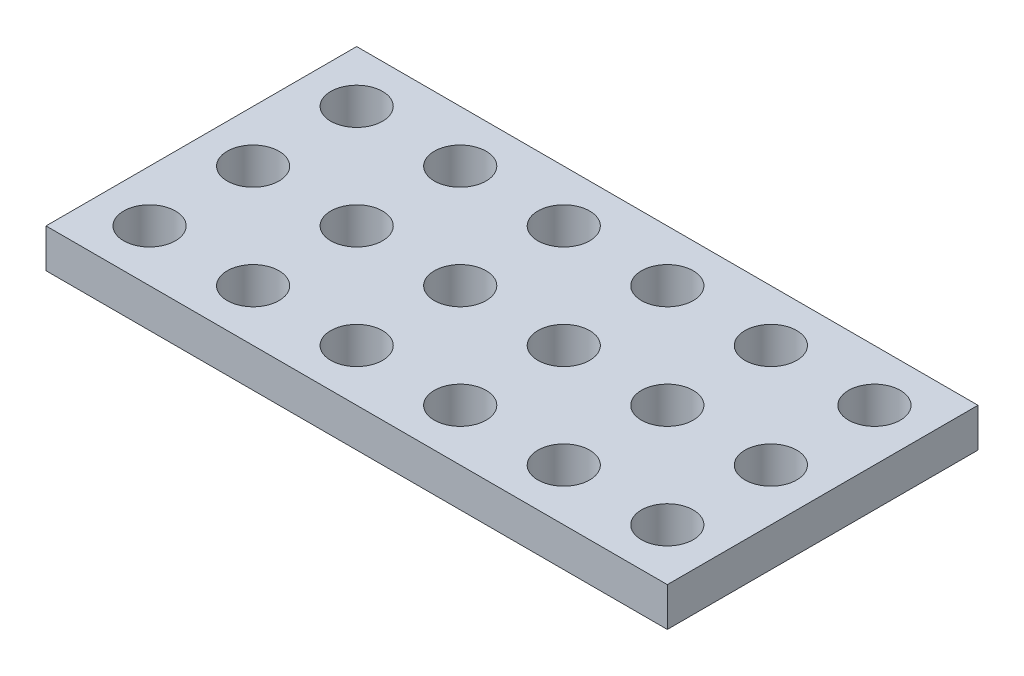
ISO-10303-21;
HEADER;
FILE_DESCRIPTION(('STEP AP214'),'2;1');
FILE_NAME('part.step','',(''),(''),'','','');
FILE_SCHEMA(('AUTOMOTIVE_DESIGN { 1 0 10303 214 1 1 1 1 }'));
ENDSEC;
DATA;
#1=APPLICATION_CONTEXT('core data for automotive mechanical design processes');
#2=APPLICATION_PROTOCOL_DEFINITION('international standard','automotive_design',2000,#1);
#3=PRODUCT_CONTEXT('',#1,'mechanical');
#4=PRODUCT('Part','Part','',(#3));
#5=PRODUCT_RELATED_PRODUCT_CATEGORY('part','',(#4));
#6=PRODUCT_DEFINITION_FORMATION('','',#4);
#7=PRODUCT_DEFINITION_CONTEXT('part definition',#1,'design');
#8=PRODUCT_DEFINITION('design','',#6,#7);
#9=PRODUCT_DEFINITION_SHAPE('','',#8);
#10=(LENGTH_UNIT() NAMED_UNIT(*) SI_UNIT(.MILLI.,.METRE.));
#11=(NAMED_UNIT(*) PLANE_ANGLE_UNIT() SI_UNIT($,.RADIAN.));
#12=(NAMED_UNIT(*) SI_UNIT($,.STERADIAN.) SOLID_ANGLE_UNIT());
#13=UNCERTAINTY_MEASURE_WITH_UNIT(LENGTH_MEASURE(1.E-05),#10,'distance_accuracy_value','');
#14=(GEOMETRIC_REPRESENTATION_CONTEXT(3) GLOBAL_UNCERTAINTY_ASSIGNED_CONTEXT((#13)) GLOBAL_UNIT_ASSIGNED_CONTEXT((#10,
#11,#12)) REPRESENTATION_CONTEXT('',''));
#15=CARTESIAN_POINT('',(0.,0.,0.));
#16=DIRECTION('',(0.,0.,1.));
#17=DIRECTION('',(1.,0.,0.));
#18=AXIS2_PLACEMENT_3D('',#15,#16,#17);
#19=CARTESIAN_POINT('',(0.,3.,0.));
#20=DIRECTION('',(0.,1.,0.));
#21=DIRECTION('',(0.,0.,1.));
#22=AXIS2_PLACEMENT_3D('',#19,#20,#21);
#23=PLANE('',#22);
#24=CARTESIAN_POINT('',(14.2666666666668,3.,9.06666666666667));
#25=DIRECTION('',(0.,1.,0.));
#26=DIRECTION('',(0.,0.,1.));
#27=AXIS2_PLACEMENT_3D('',#24,#25,#26);
#28=CIRCLE('',#27,2.);
#29=CARTESIAN_POINT('',(14.2666666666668,3.,11.0666666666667));
#30=VERTEX_POINT('',#29);
#31=EDGE_CURVE('E207',#30,#30,#28,.T.);
#32=ORIENTED_EDGE('',*,*,#31,.F.);
#33=EDGE_LOOP('',(#32));
#34=FACE_BOUND('',#33,.T.);
#35=CARTESIAN_POINT('',(-1.73333333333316,3.,9.06666666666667));
#36=DIRECTION('',(0.,1.,0.));
#37=DIRECTION('',(0.,0.,1.));
#38=AXIS2_PLACEMENT_3D('',#35,#36,#37);
#39=CIRCLE('',#38,2.);
#40=CARTESIAN_POINT('',(-1.73333333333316,3.,11.0666666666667));
#41=VERTEX_POINT('',#40);
#42=EDGE_CURVE('E195',#41,#41,#39,.T.);
#43=ORIENTED_EDGE('',*,*,#42,.F.);
#44=EDGE_LOOP('',(#43));
#45=FACE_BOUND('',#44,.T.);
#46=CARTESIAN_POINT('',(-17.7333333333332,3.,9.06666666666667));
#47=DIRECTION('',(0.,1.,0.));
#48=DIRECTION('',(0.,0.,1.));
#49=AXIS2_PLACEMENT_3D('',#46,#47,#48);
#50=CIRCLE('',#49,2.);
#51=CARTESIAN_POINT('',(-17.7333333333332,3.,11.0666666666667));
#52=VERTEX_POINT('',#51);
#53=EDGE_CURVE('E183',#52,#52,#50,.T.);
#54=ORIENTED_EDGE('',*,*,#53,.F.);
#55=EDGE_LOOP('',(#54));
#56=FACE_BOUND('',#55,.T.);
#57=CARTESIAN_POINT('',(14.2666666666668,3.,1.06666666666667));
#58=DIRECTION('',(0.,1.,0.));
#59=DIRECTION('',(0.,0.,1.));
#60=AXIS2_PLACEMENT_3D('',#57,#58,#59);
#61=CIRCLE('',#60,2.);
#62=CARTESIAN_POINT('',(14.2666666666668,3.,3.06666666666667));
#63=VERTEX_POINT('',#62);
#64=EDGE_CURVE('E171',#63,#63,#61,.T.);
#65=ORIENTED_EDGE('',*,*,#64,.F.);
#66=EDGE_LOOP('',(#65));
#67=FACE_BOUND('',#66,.T.);
#68=CARTESIAN_POINT('',(-1.73333333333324,3.,1.06666666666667));
#69=DIRECTION('',(0.,1.,0.));
#70=DIRECTION('',(0.,0.,1.));
#71=AXIS2_PLACEMENT_3D('',#68,#69,#70);
#72=CIRCLE('',#71,2.);
#73=CARTESIAN_POINT('',(-1.73333333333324,3.,3.06666666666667));
#74=VERTEX_POINT('',#73);
#75=EDGE_CURVE('E159',#74,#74,#72,.T.);
#76=ORIENTED_EDGE('',*,*,#75,.F.);
#77=EDGE_LOOP('',(#76));
#78=FACE_BOUND('',#77,.T.);
#79=CARTESIAN_POINT('',(-17.7333333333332,3.,1.06666666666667));
#80=DIRECTION('',(0.,1.,0.));
#81=DIRECTION('',(0.,0.,1.));
#82=AXIS2_PLACEMENT_3D('',#79,#80,#81);
#83=CIRCLE('',#82,2.);
#84=CARTESIAN_POINT('',(-17.7333333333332,3.,3.06666666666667));
#85=VERTEX_POINT('',#84);
#86=EDGE_CURVE('E147',#85,#85,#83,.T.);
#87=ORIENTED_EDGE('',*,*,#86,.F.);
#88=EDGE_LOOP('',(#87));
#89=FACE_BOUND('',#88,.T.);
#90=CARTESIAN_POINT('',(14.2666666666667,3.,-6.93333333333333));
#91=DIRECTION('',(0.,1.,0.));
#92=DIRECTION('',(0.,0.,1.));
#93=AXIS2_PLACEMENT_3D('',#90,#91,#92);
#94=CIRCLE('',#93,2.);
#95=CARTESIAN_POINT('',(14.2666666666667,3.,-4.93333333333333));
#96=VERTEX_POINT('',#95);
#97=EDGE_CURVE('E135',#96,#96,#94,.T.);
#98=ORIENTED_EDGE('',*,*,#97,.F.);
#99=EDGE_LOOP('',(#98));
#100=FACE_BOUND('',#99,.T.);
#101=CARTESIAN_POINT('',(-1.73333333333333,3.,-6.93333333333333));
#102=DIRECTION('',(0.,1.,0.));
#103=DIRECTION('',(0.,0.,1.));
#104=AXIS2_PLACEMENT_3D('',#101,#102,#103);
#105=CIRCLE('',#104,2.);
#106=CARTESIAN_POINT('',(-1.73333333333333,3.,-4.93333333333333));
#107=VERTEX_POINT('',#106);
#108=EDGE_CURVE('E123',#107,#107,#105,.T.);
#109=ORIENTED_EDGE('',*,*,#108,.F.);
#110=EDGE_LOOP('',(#109));
#111=FACE_BOUND('',#110,.T.);
#112=CARTESIAN_POINT('',(-17.7333333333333,3.,-6.93333333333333));
#113=DIRECTION('',(0.,1.,0.));
#114=DIRECTION('',(0.,0.,1.));
#115=AXIS2_PLACEMENT_3D('',#112,#113,#114);
#116=CIRCLE('',#115,2.);
#117=CARTESIAN_POINT('',(-17.7333333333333,3.,-4.93333333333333));
#118=VERTEX_POINT('',#117);
#119=EDGE_CURVE('E102',#118,#118,#116,.T.);
#120=ORIENTED_EDGE('',*,*,#119,.F.);
#121=EDGE_LOOP('',(#120));
#122=FACE_BOUND('',#121,.T.);
#123=DIRECTION('',(0.,0.,1.));
#124=VECTOR('',#123,1.);
#125=CARTESIAN_POINT('',(-21.7333333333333,3.,-10.9333333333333));
#126=LINE('',#125,#124);
#127=CARTESIAN_POINT('',(-21.7333333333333,3.,-10.9333333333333));
#128=VERTEX_POINT('',#127);
#129=CARTESIAN_POINT('',(-21.7333333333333,3.,13.0666666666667));
#130=VERTEX_POINT('',#129);
#131=EDGE_CURVE('E87',#128,#130,#126,.T.);
#132=ORIENTED_EDGE('',*,*,#131,.T.);
#133=DIRECTION('',(1.,0.,0.));
#134=VECTOR('',#133,1.);
#135=CARTESIAN_POINT('',(-21.7333333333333,3.,13.0666666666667));
#136=LINE('',#135,#134);
#137=CARTESIAN_POINT('',(26.2666666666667,3.,13.0666666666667));
#138=VERTEX_POINT('',#137);
#139=EDGE_CURVE('E82',#130,#138,#136,.T.);
#140=ORIENTED_EDGE('',*,*,#139,.T.);
#141=DIRECTION('',(0.,0.,-1.));
#142=VECTOR('',#141,1.);
#143=CARTESIAN_POINT('',(26.2666666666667,3.,-10.9333333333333));
#144=LINE('',#143,#142);
#145=CARTESIAN_POINT('',(26.2666666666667,3.,-10.9333333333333));
#146=VERTEX_POINT('',#145);
#147=EDGE_CURVE('E85',#138,#146,#144,.T.);
#148=ORIENTED_EDGE('',*,*,#147,.T.);
#149=DIRECTION('',(-1.,0.,0.));
#150=VECTOR('',#149,1.);
#151=CARTESIAN_POINT('',(-21.7333333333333,3.,-10.9333333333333));
#152=LINE('',#151,#150);
#153=EDGE_CURVE('E52',#146,#128,#152,.T.);
#154=ORIENTED_EDGE('',*,*,#153,.T.);
#155=EDGE_LOOP('',(#132,#140,#148,#154));
#156=FACE_BOUND('',#155,.T.);
#157=CARTESIAN_POINT('',(-9.73333333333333,3.,-6.93333333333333));
#158=DIRECTION('',(0.,1.,0.));
#159=DIRECTION('',(0.,0.,1.));
#160=AXIS2_PLACEMENT_3D('',#157,#158,#159);
#161=CIRCLE('',#160,2.);
#162=CARTESIAN_POINT('',(-9.73333333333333,3.,-4.93333333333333));
#163=VERTEX_POINT('',#162);
#164=EDGE_CURVE('E117',#163,#163,#161,.T.);
#165=ORIENTED_EDGE('',*,*,#164,.F.);
#166=EDGE_LOOP('',(#165));
#167=FACE_BOUND('',#166,.T.);
#168=CARTESIAN_POINT('',(6.26666666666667,3.,-6.93333333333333));
#169=DIRECTION('',(0.,1.,0.));
#170=DIRECTION('',(0.,0.,1.));
#171=AXIS2_PLACEMENT_3D('',#168,#169,#170);
#172=CIRCLE('',#171,2.);
#173=CARTESIAN_POINT('',(6.26666666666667,3.,-4.93333333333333));
#174=VERTEX_POINT('',#173);
#175=EDGE_CURVE('E129',#174,#174,#172,.T.);
#176=ORIENTED_EDGE('',*,*,#175,.F.);
#177=EDGE_LOOP('',(#176));
#178=FACE_BOUND('',#177,.T.);
#179=CARTESIAN_POINT('',(22.2666666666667,3.,-6.93333333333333));
#180=DIRECTION('',(0.,1.,0.));
#181=DIRECTION('',(0.,0.,1.));
#182=AXIS2_PLACEMENT_3D('',#179,#180,#181);
#183=CIRCLE('',#182,2.);
#184=CARTESIAN_POINT('',(22.2666666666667,3.,-4.93333333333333));
#185=VERTEX_POINT('',#184);
#186=EDGE_CURVE('E141',#185,#185,#183,.T.);
#187=ORIENTED_EDGE('',*,*,#186,.F.);
#188=EDGE_LOOP('',(#187));
#189=FACE_BOUND('',#188,.T.);
#190=CARTESIAN_POINT('',(-9.73333333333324,3.,1.06666666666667));
#191=DIRECTION('',(0.,1.,0.));
#192=DIRECTION('',(0.,0.,1.));
#193=AXIS2_PLACEMENT_3D('',#190,#191,#192);
#194=CIRCLE('',#193,2.);
#195=CARTESIAN_POINT('',(-9.73333333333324,3.,3.06666666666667));
#196=VERTEX_POINT('',#195);
#197=EDGE_CURVE('E153',#196,#196,#194,.T.);
#198=ORIENTED_EDGE('',*,*,#197,.F.);
#199=EDGE_LOOP('',(#198));
#200=FACE_BOUND('',#199,.T.);
#201=CARTESIAN_POINT('',(6.26666666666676,3.,1.06666666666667));
#202=DIRECTION('',(0.,1.,0.));
#203=DIRECTION('',(0.,0.,1.));
#204=AXIS2_PLACEMENT_3D('',#201,#202,#203);
#205=CIRCLE('',#204,2.);
#206=CARTESIAN_POINT('',(6.26666666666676,3.,3.06666666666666));
#207=VERTEX_POINT('',#206);
#208=EDGE_CURVE('E165',#207,#207,#205,.T.);
#209=ORIENTED_EDGE('',*,*,#208,.F.);
#210=EDGE_LOOP('',(#209));
#211=FACE_BOUND('',#210,.T.);
#212=CARTESIAN_POINT('',(22.2666666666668,3.,1.06666666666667));
#213=DIRECTION('',(0.,1.,0.));
#214=DIRECTION('',(0.,0.,1.));
#215=AXIS2_PLACEMENT_3D('',#212,#213,#214);
#216=CIRCLE('',#215,2.);
#217=CARTESIAN_POINT('',(22.2666666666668,3.,3.06666666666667));
#218=VERTEX_POINT('',#217);
#219=EDGE_CURVE('E177',#218,#218,#216,.T.);
#220=ORIENTED_EDGE('',*,*,#219,.F.);
#221=EDGE_LOOP('',(#220));
#222=FACE_BOUND('',#221,.T.);
#223=CARTESIAN_POINT('',(-9.73333333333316,3.,9.06666666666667));
#224=DIRECTION('',(0.,1.,0.));
#225=DIRECTION('',(0.,0.,1.));
#226=AXIS2_PLACEMENT_3D('',#223,#224,#225);
#227=CIRCLE('',#226,2.);
#228=CARTESIAN_POINT('',(-9.73333333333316,3.,11.0666666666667));
#229=VERTEX_POINT('',#228);
#230=EDGE_CURVE('E189',#229,#229,#227,.T.);
#231=ORIENTED_EDGE('',*,*,#230,.F.);
#232=EDGE_LOOP('',(#231));
#233=FACE_BOUND('',#232,.T.);
#234=CARTESIAN_POINT('',(6.26666666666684,3.,9.06666666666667));
#235=DIRECTION('',(0.,1.,0.));
#236=DIRECTION('',(0.,0.,1.));
#237=AXIS2_PLACEMENT_3D('',#234,#235,#236);
#238=CIRCLE('',#237,2.);
#239=CARTESIAN_POINT('',(6.26666666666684,3.,11.0666666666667));
#240=VERTEX_POINT('',#239);
#241=EDGE_CURVE('E201',#240,#240,#238,.T.);
#242=ORIENTED_EDGE('',*,*,#241,.F.);
#243=EDGE_LOOP('',(#242));
#244=FACE_BOUND('',#243,.T.);
#245=CARTESIAN_POINT('',(22.2666666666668,3.,9.06666666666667));
#246=DIRECTION('',(0.,1.,0.));
#247=DIRECTION('',(0.,0.,1.));
#248=AXIS2_PLACEMENT_3D('',#245,#246,#247);
#249=CIRCLE('',#248,2.);
#250=CARTESIAN_POINT('',(22.2666666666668,3.,11.0666666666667));
#251=VERTEX_POINT('',#250);
#252=EDGE_CURVE('E213',#251,#251,#249,.T.);
#253=ORIENTED_EDGE('',*,*,#252,.F.);
#254=EDGE_LOOP('',(#253));
#255=FACE_BOUND('',#254,.T.);
#256=ADVANCED_FACE('F35',(#34,#45,#56,#67,#78,#89,#100,#111,#122,#156,#167,#178,#189,#200,#211,
#222,#233,#244,#255),#23,.T.);
#257=CARTESIAN_POINT('',(0.,0.,0.));
#258=DIRECTION('',(0.,1.,0.));
#259=DIRECTION('',(0.,0.,1.));
#260=AXIS2_PLACEMENT_3D('',#257,#258,#259);
#261=PLANE('',#260);
#262=DIRECTION('',(0.,0.,1.));
#263=VECTOR('',#262,1.);
#264=CARTESIAN_POINT('',(-21.7333333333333,0.,-10.9333333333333));
#265=LINE('',#264,#263);
#266=CARTESIAN_POINT('',(-21.7333333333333,0.,-10.9333333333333));
#267=VERTEX_POINT('',#266);
#268=CARTESIAN_POINT('',(-21.7333333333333,0.,13.0666666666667));
#269=VERTEX_POINT('',#268);
#270=EDGE_CURVE('E99',#267,#269,#265,.T.);
#271=ORIENTED_EDGE('',*,*,#270,.F.);
#272=DIRECTION('',(-1.,0.,0.));
#273=VECTOR('',#272,1.);
#274=CARTESIAN_POINT('',(-21.7333333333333,0.,-10.9333333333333));
#275=LINE('',#274,#273);
#276=CARTESIAN_POINT('',(26.2666666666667,0.,-10.9333333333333));
#277=VERTEX_POINT('',#276);
#278=EDGE_CURVE('E75',#277,#267,#275,.T.);
#279=ORIENTED_EDGE('',*,*,#278,.F.);
#280=DIRECTION('',(0.,0.,-1.));
#281=VECTOR('',#280,1.);
#282=CARTESIAN_POINT('',(26.2666666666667,0.,-10.9333333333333));
#283=LINE('',#282,#281);
#284=CARTESIAN_POINT('',(26.2666666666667,0.,13.0666666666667));
#285=VERTEX_POINT('',#284);
#286=EDGE_CURVE('E69',#285,#277,#283,.T.);
#287=ORIENTED_EDGE('',*,*,#286,.F.);
#288=DIRECTION('',(1.,0.,0.));
#289=VECTOR('',#288,1.);
#290=CARTESIAN_POINT('',(-21.7333333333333,0.,13.0666666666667));
#291=LINE('',#290,#289);
#292=EDGE_CURVE('E91',#269,#285,#291,.T.);
#293=ORIENTED_EDGE('',*,*,#292,.F.);
#294=EDGE_LOOP('',(#271,#279,#287,#293));
#295=FACE_BOUND('',#294,.T.);
#296=CARTESIAN_POINT('',(-17.7333333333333,0.,-6.93333333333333));
#297=DIRECTION('',(0.,1.,0.));
#298=DIRECTION('',(0.,0.,1.));
#299=AXIS2_PLACEMENT_3D('',#296,#297,#298);
#300=CIRCLE('',#299,2.);
#301=CARTESIAN_POINT('',(-17.7333333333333,0.,-4.93333333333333));
#302=VERTEX_POINT('',#301);
#303=EDGE_CURVE('E114',#302,#302,#300,.T.);
#304=ORIENTED_EDGE('',*,*,#303,.T.);
#305=EDGE_LOOP('',(#304));
#306=FACE_BOUND('',#305,.T.);
#307=CARTESIAN_POINT('',(-9.73333333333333,0.,-6.93333333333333));
#308=DIRECTION('',(0.,1.,0.));
#309=DIRECTION('',(0.,0.,1.));
#310=AXIS2_PLACEMENT_3D('',#307,#308,#309);
#311=CIRCLE('',#310,2.);
#312=CARTESIAN_POINT('',(-9.73333333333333,0.,-4.93333333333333));
#313=VERTEX_POINT('',#312);
#314=EDGE_CURVE('E120',#313,#313,#311,.T.);
#315=ORIENTED_EDGE('',*,*,#314,.T.);
#316=EDGE_LOOP('',(#315));
#317=FACE_BOUND('',#316,.T.);
#318=CARTESIAN_POINT('',(-1.73333333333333,0.,-6.93333333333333));
#319=DIRECTION('',(0.,1.,0.));
#320=DIRECTION('',(0.,0.,1.));
#321=AXIS2_PLACEMENT_3D('',#318,#319,#320);
#322=CIRCLE('',#321,2.);
#323=CARTESIAN_POINT('',(-1.73333333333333,0.,-4.93333333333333));
#324=VERTEX_POINT('',#323);
#325=EDGE_CURVE('E126',#324,#324,#322,.T.);
#326=ORIENTED_EDGE('',*,*,#325,.T.);
#327=EDGE_LOOP('',(#326));
#328=FACE_BOUND('',#327,.T.);
#329=CARTESIAN_POINT('',(6.26666666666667,0.,-6.93333333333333));
#330=DIRECTION('',(0.,1.,0.));
#331=DIRECTION('',(0.,0.,1.));
#332=AXIS2_PLACEMENT_3D('',#329,#330,#331);
#333=CIRCLE('',#332,2.);
#334=CARTESIAN_POINT('',(6.26666666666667,0.,-4.93333333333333));
#335=VERTEX_POINT('',#334);
#336=EDGE_CURVE('E132',#335,#335,#333,.T.);
#337=ORIENTED_EDGE('',*,*,#336,.T.);
#338=EDGE_LOOP('',(#337));
#339=FACE_BOUND('',#338,.T.);
#340=CARTESIAN_POINT('',(14.2666666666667,0.,-6.93333333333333));
#341=DIRECTION('',(0.,1.,0.));
#342=DIRECTION('',(0.,0.,1.));
#343=AXIS2_PLACEMENT_3D('',#340,#341,#342);
#344=CIRCLE('',#343,2.);
#345=CARTESIAN_POINT('',(14.2666666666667,0.,-4.93333333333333));
#346=VERTEX_POINT('',#345);
#347=EDGE_CURVE('E138',#346,#346,#344,.T.);
#348=ORIENTED_EDGE('',*,*,#347,.T.);
#349=EDGE_LOOP('',(#348));
#350=FACE_BOUND('',#349,.T.);
#351=CARTESIAN_POINT('',(22.2666666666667,0.,-6.93333333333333));
#352=DIRECTION('',(0.,1.,0.));
#353=DIRECTION('',(0.,0.,1.));
#354=AXIS2_PLACEMENT_3D('',#351,#352,#353);
#355=CIRCLE('',#354,2.);
#356=CARTESIAN_POINT('',(22.2666666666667,0.,-4.93333333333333));
#357=VERTEX_POINT('',#356);
#358=EDGE_CURVE('E144',#357,#357,#355,.T.);
#359=ORIENTED_EDGE('',*,*,#358,.T.);
#360=EDGE_LOOP('',(#359));
#361=FACE_BOUND('',#360,.T.);
#362=CARTESIAN_POINT('',(-17.7333333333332,0.,1.06666666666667));
#363=DIRECTION('',(0.,1.,0.));
#364=DIRECTION('',(0.,0.,1.));
#365=AXIS2_PLACEMENT_3D('',#362,#363,#364);
#366=CIRCLE('',#365,2.);
#367=CARTESIAN_POINT('',(-17.7333333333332,0.,3.06666666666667));
#368=VERTEX_POINT('',#367);
#369=EDGE_CURVE('E150',#368,#368,#366,.T.);
#370=ORIENTED_EDGE('',*,*,#369,.T.);
#371=EDGE_LOOP('',(#370));
#372=FACE_BOUND('',#371,.T.);
#373=CARTESIAN_POINT('',(-9.73333333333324,0.,1.06666666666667));
#374=DIRECTION('',(0.,1.,0.));
#375=DIRECTION('',(0.,0.,1.));
#376=AXIS2_PLACEMENT_3D('',#373,#374,#375);
#377=CIRCLE('',#376,2.);
#378=CARTESIAN_POINT('',(-9.73333333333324,0.,3.06666666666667));
#379=VERTEX_POINT('',#378);
#380=EDGE_CURVE('E156',#379,#379,#377,.T.);
#381=ORIENTED_EDGE('',*,*,#380,.T.);
#382=EDGE_LOOP('',(#381));
#383=FACE_BOUND('',#382,.T.);
#384=CARTESIAN_POINT('',(-1.73333333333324,0.,1.06666666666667));
#385=DIRECTION('',(0.,1.,0.));
#386=DIRECTION('',(0.,0.,1.));
#387=AXIS2_PLACEMENT_3D('',#384,#385,#386);
#388=CIRCLE('',#387,2.);
#389=CARTESIAN_POINT('',(-1.73333333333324,0.,3.06666666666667));
#390=VERTEX_POINT('',#389);
#391=EDGE_CURVE('E162',#390,#390,#388,.T.);
#392=ORIENTED_EDGE('',*,*,#391,.T.);
#393=EDGE_LOOP('',(#392));
#394=FACE_BOUND('',#393,.T.);
#395=CARTESIAN_POINT('',(6.26666666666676,0.,1.06666666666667));
#396=DIRECTION('',(0.,1.,0.));
#397=DIRECTION('',(0.,0.,1.));
#398=AXIS2_PLACEMENT_3D('',#395,#396,#397);
#399=CIRCLE('',#398,2.);
#400=CARTESIAN_POINT('',(6.26666666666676,0.,3.06666666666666));
#401=VERTEX_POINT('',#400);
#402=EDGE_CURVE('E168',#401,#401,#399,.T.);
#403=ORIENTED_EDGE('',*,*,#402,.T.);
#404=EDGE_LOOP('',(#403));
#405=FACE_BOUND('',#404,.T.);
#406=CARTESIAN_POINT('',(14.2666666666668,0.,1.06666666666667));
#407=DIRECTION('',(0.,1.,0.));
#408=DIRECTION('',(0.,0.,1.));
#409=AXIS2_PLACEMENT_3D('',#406,#407,#408);
#410=CIRCLE('',#409,2.);
#411=CARTESIAN_POINT('',(14.2666666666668,0.,3.06666666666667));
#412=VERTEX_POINT('',#411);
#413=EDGE_CURVE('E174',#412,#412,#410,.T.);
#414=ORIENTED_EDGE('',*,*,#413,.T.);
#415=EDGE_LOOP('',(#414));
#416=FACE_BOUND('',#415,.T.);
#417=CARTESIAN_POINT('',(22.2666666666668,0.,1.06666666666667));
#418=DIRECTION('',(0.,1.,0.));
#419=DIRECTION('',(0.,0.,1.));
#420=AXIS2_PLACEMENT_3D('',#417,#418,#419);
#421=CIRCLE('',#420,2.);
#422=CARTESIAN_POINT('',(22.2666666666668,0.,3.06666666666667));
#423=VERTEX_POINT('',#422);
#424=EDGE_CURVE('E180',#423,#423,#421,.T.);
#425=ORIENTED_EDGE('',*,*,#424,.T.);
#426=EDGE_LOOP('',(#425));
#427=FACE_BOUND('',#426,.T.);
#428=CARTESIAN_POINT('',(-17.7333333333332,0.,9.06666666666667));
#429=DIRECTION('',(0.,1.,0.));
#430=DIRECTION('',(0.,0.,1.));
#431=AXIS2_PLACEMENT_3D('',#428,#429,#430);
#432=CIRCLE('',#431,2.);
#433=CARTESIAN_POINT('',(-17.7333333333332,0.,11.0666666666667));
#434=VERTEX_POINT('',#433);
#435=EDGE_CURVE('E186',#434,#434,#432,.T.);
#436=ORIENTED_EDGE('',*,*,#435,.T.);
#437=EDGE_LOOP('',(#436));
#438=FACE_BOUND('',#437,.T.);
#439=CARTESIAN_POINT('',(-9.73333333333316,0.,9.06666666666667));
#440=DIRECTION('',(0.,1.,0.));
#441=DIRECTION('',(0.,0.,1.));
#442=AXIS2_PLACEMENT_3D('',#439,#440,#441);
#443=CIRCLE('',#442,2.);
#444=CARTESIAN_POINT('',(-9.73333333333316,0.,11.0666666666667));
#445=VERTEX_POINT('',#444);
#446=EDGE_CURVE('E192',#445,#445,#443,.T.);
#447=ORIENTED_EDGE('',*,*,#446,.T.);
#448=EDGE_LOOP('',(#447));
#449=FACE_BOUND('',#448,.T.);
#450=CARTESIAN_POINT('',(-1.73333333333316,0.,9.06666666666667));
#451=DIRECTION('',(0.,1.,0.));
#452=DIRECTION('',(0.,0.,1.));
#453=AXIS2_PLACEMENT_3D('',#450,#451,#452);
#454=CIRCLE('',#453,2.);
#455=CARTESIAN_POINT('',(-1.73333333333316,0.,11.0666666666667));
#456=VERTEX_POINT('',#455);
#457=EDGE_CURVE('E198',#456,#456,#454,.T.);
#458=ORIENTED_EDGE('',*,*,#457,.T.);
#459=EDGE_LOOP('',(#458));
#460=FACE_BOUND('',#459,.T.);
#461=CARTESIAN_POINT('',(6.26666666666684,0.,9.06666666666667));
#462=DIRECTION('',(0.,1.,0.));
#463=DIRECTION('',(0.,0.,1.));
#464=AXIS2_PLACEMENT_3D('',#461,#462,#463);
#465=CIRCLE('',#464,2.);
#466=CARTESIAN_POINT('',(6.26666666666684,0.,11.0666666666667));
#467=VERTEX_POINT('',#466);
#468=EDGE_CURVE('E204',#467,#467,#465,.T.);
#469=ORIENTED_EDGE('',*,*,#468,.T.);
#470=EDGE_LOOP('',(#469));
#471=FACE_BOUND('',#470,.T.);
#472=CARTESIAN_POINT('',(14.2666666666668,0.,9.06666666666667));
#473=DIRECTION('',(0.,1.,0.));
#474=DIRECTION('',(0.,0.,1.));
#475=AXIS2_PLACEMENT_3D('',#472,#473,#474);
#476=CIRCLE('',#475,2.);
#477=CARTESIAN_POINT('',(14.2666666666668,0.,11.0666666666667));
#478=VERTEX_POINT('',#477);
#479=EDGE_CURVE('E210',#478,#478,#476,.T.);
#480=ORIENTED_EDGE('',*,*,#479,.T.);
#481=EDGE_LOOP('',(#480));
#482=FACE_BOUND('',#481,.T.);
#483=CARTESIAN_POINT('',(22.2666666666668,0.,9.06666666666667));
#484=DIRECTION('',(0.,1.,0.));
#485=DIRECTION('',(0.,0.,1.));
#486=AXIS2_PLACEMENT_3D('',#483,#484,#485);
#487=CIRCLE('',#486,2.);
#488=CARTESIAN_POINT('',(22.2666666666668,0.,11.0666666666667));
#489=VERTEX_POINT('',#488);
#490=EDGE_CURVE('E216',#489,#489,#487,.T.);
#491=ORIENTED_EDGE('',*,*,#490,.T.);
#492=EDGE_LOOP('',(#491));
#493=FACE_BOUND('',#492,.T.);
#494=ADVANCED_FACE('F110',(#295,#306,#317,#328,#339,#350,#361,#372,#383,#394,#405,#416,#427,
#438,#449,#460,#471,#482,#493),#261,.F.);
#495=CARTESIAN_POINT('',(-21.7333333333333,3.,-10.9333333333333));
#496=DIRECTION('',(1.,0.,0.));
#497=DIRECTION('',(0.,0.,-1.));
#498=AXIS2_PLACEMENT_3D('',#495,#496,#497);
#499=PLANE('',#498);
#500=ORIENTED_EDGE('',*,*,#270,.T.);
#501=DIRECTION('',(0.,-1.,0.));
#502=VECTOR('',#501,1.);
#503=CARTESIAN_POINT('',(-21.7333333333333,3.,13.0666666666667));
#504=LINE('',#503,#502);
#505=EDGE_CURVE('E11',#130,#269,#504,.T.);
#506=ORIENTED_EDGE('',*,*,#505,.F.);
#507=ORIENTED_EDGE('',*,*,#131,.F.);
#508=DIRECTION('',(0.,-1.,0.));
#509=VECTOR('',#508,1.);
#510=CARTESIAN_POINT('',(-21.7333333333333,3.,-10.9333333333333));
#511=LINE('',#510,#509);
#512=EDGE_CURVE('E95',#128,#267,#511,.T.);
#513=ORIENTED_EDGE('',*,*,#512,.T.);
#514=EDGE_LOOP('',(#500,#506,#507,#513));
#515=FACE_BOUND('',#514,.T.);
#516=ADVANCED_FACE('F37',(#515),#499,.F.);
#517=CARTESIAN_POINT('',(-21.7333333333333,3.,13.0666666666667));
#518=DIRECTION('',(0.,0.,-1.));
#519=DIRECTION('',(-1.,0.,0.));
#520=AXIS2_PLACEMENT_3D('',#517,#518,#519);
#521=PLANE('',#520);
#522=ORIENTED_EDGE('',*,*,#292,.T.);
#523=DIRECTION('',(0.,-1.,0.));
#524=VECTOR('',#523,1.);
#525=CARTESIAN_POINT('',(26.2666666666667,3.,13.0666666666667));
#526=LINE('',#525,#524);
#527=EDGE_CURVE('E44',#138,#285,#526,.T.);
#528=ORIENTED_EDGE('',*,*,#527,.F.);
#529=ORIENTED_EDGE('',*,*,#139,.F.);
#530=ORIENTED_EDGE('',*,*,#505,.T.);
#531=EDGE_LOOP('',(#522,#528,#529,#530));
#532=FACE_BOUND('',#531,.T.);
#533=ADVANCED_FACE('F90',(#532),#521,.F.);
#534=CARTESIAN_POINT('',(26.2666666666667,3.,-10.9333333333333));
#535=DIRECTION('',(-1.,0.,0.));
#536=DIRECTION('',(0.,0.,1.));
#537=AXIS2_PLACEMENT_3D('',#534,#535,#536);
#538=PLANE('',#537);
#539=ORIENTED_EDGE('',*,*,#286,.T.);
#540=DIRECTION('',(0.,-1.,0.));
#541=VECTOR('',#540,1.);
#542=CARTESIAN_POINT('',(26.2666666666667,3.,-10.9333333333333));
#543=LINE('',#542,#541);
#544=EDGE_CURVE('E92',#146,#277,#543,.T.);
#545=ORIENTED_EDGE('',*,*,#544,.F.);
#546=ORIENTED_EDGE('',*,*,#147,.F.);
#547=ORIENTED_EDGE('',*,*,#527,.T.);
#548=EDGE_LOOP('',(#539,#545,#546,#547));
#549=FACE_BOUND('',#548,.T.);
#550=ADVANCED_FACE('F93',(#549),#538,.F.);
#551=CARTESIAN_POINT('',(-21.7333333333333,3.,-10.9333333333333));
#552=DIRECTION('',(0.,0.,1.));
#553=DIRECTION('',(1.,0.,0.));
#554=AXIS2_PLACEMENT_3D('',#551,#552,#553);
#555=PLANE('',#554);
#556=ORIENTED_EDGE('',*,*,#278,.T.);
#557=ORIENTED_EDGE('',*,*,#512,.F.);
#558=ORIENTED_EDGE('',*,*,#153,.F.);
#559=ORIENTED_EDGE('',*,*,#544,.T.);
#560=EDGE_LOOP('',(#556,#557,#558,#559));
#561=FACE_BOUND('',#560,.T.);
#562=ADVANCED_FACE('F107',(#561),#555,.F.);
#563=CARTESIAN_POINT('',(-17.7333333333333,3.,-6.93333333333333));
#564=DIRECTION('',(0.,-1.,0.));
#565=DIRECTION('',(0.,0.,-1.));
#566=AXIS2_PLACEMENT_3D('',#563,#564,#565);
#567=CYLINDRICAL_SURFACE('',#566,2.);
#568=ORIENTED_EDGE('',*,*,#119,.T.);
#569=EDGE_LOOP('',(#568));
#570=FACE_BOUND('',#569,.T.);
#571=ORIENTED_EDGE('',*,*,#303,.F.);
#572=EDGE_LOOP('',(#571));
#573=FACE_BOUND('',#572,.T.);
#574=ADVANCED_FACE('F235',(#570,#573),#567,.F.);
#575=CARTESIAN_POINT('',(-9.73333333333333,3.,-6.93333333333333));
#576=DIRECTION('',(0.,-1.,0.));
#577=DIRECTION('',(0.,0.,-1.));
#578=AXIS2_PLACEMENT_3D('',#575,#576,#577);
#579=CYLINDRICAL_SURFACE('',#578,2.);
#580=ORIENTED_EDGE('',*,*,#164,.T.);
#581=EDGE_LOOP('',(#580));
#582=FACE_BOUND('',#581,.T.);
#583=ORIENTED_EDGE('',*,*,#314,.F.);
#584=EDGE_LOOP('',(#583));
#585=FACE_BOUND('',#584,.T.);
#586=ADVANCED_FACE('F281',(#582,#585),#579,.F.);
#587=CARTESIAN_POINT('',(-1.73333333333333,3.,-6.93333333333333));
#588=DIRECTION('',(0.,-1.,0.));
#589=DIRECTION('',(0.,0.,-1.));
#590=AXIS2_PLACEMENT_3D('',#587,#588,#589);
#591=CYLINDRICAL_SURFACE('',#590,2.);
#592=ORIENTED_EDGE('',*,*,#108,.T.);
#593=EDGE_LOOP('',(#592));
#594=FACE_BOUND('',#593,.T.);
#595=ORIENTED_EDGE('',*,*,#325,.F.);
#596=EDGE_LOOP('',(#595));
#597=FACE_BOUND('',#596,.T.);
#598=ADVANCED_FACE('F289',(#594,#597),#591,.F.);
#599=CARTESIAN_POINT('',(6.26666666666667,3.,-6.93333333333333));
#600=DIRECTION('',(0.,-1.,0.));
#601=DIRECTION('',(0.,0.,-1.));
#602=AXIS2_PLACEMENT_3D('',#599,#600,#601);
#603=CYLINDRICAL_SURFACE('',#602,2.);
#604=ORIENTED_EDGE('',*,*,#175,.T.);
#605=EDGE_LOOP('',(#604));
#606=FACE_BOUND('',#605,.T.);
#607=ORIENTED_EDGE('',*,*,#336,.F.);
#608=EDGE_LOOP('',(#607));
#609=FACE_BOUND('',#608,.T.);
#610=ADVANCED_FACE('F297',(#606,#609),#603,.F.);
#611=CARTESIAN_POINT('',(14.2666666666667,3.,-6.93333333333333));
#612=DIRECTION('',(0.,-1.,0.));
#613=DIRECTION('',(0.,0.,-1.));
#614=AXIS2_PLACEMENT_3D('',#611,#612,#613);
#615=CYLINDRICAL_SURFACE('',#614,2.);
#616=ORIENTED_EDGE('',*,*,#97,.T.);
#617=EDGE_LOOP('',(#616));
#618=FACE_BOUND('',#617,.T.);
#619=ORIENTED_EDGE('',*,*,#347,.F.);
#620=EDGE_LOOP('',(#619));
#621=FACE_BOUND('',#620,.T.);
#622=ADVANCED_FACE('F306',(#618,#621),#615,.F.);
#623=CARTESIAN_POINT('',(22.2666666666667,3.,-6.93333333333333));
#624=DIRECTION('',(0.,-1.,0.));
#625=DIRECTION('',(0.,0.,-1.));
#626=AXIS2_PLACEMENT_3D('',#623,#624,#625);
#627=CYLINDRICAL_SURFACE('',#626,2.);
#628=ORIENTED_EDGE('',*,*,#186,.T.);
#629=EDGE_LOOP('',(#628));
#630=FACE_BOUND('',#629,.T.);
#631=ORIENTED_EDGE('',*,*,#358,.F.);
#632=EDGE_LOOP('',(#631));
#633=FACE_BOUND('',#632,.T.);
#634=ADVANCED_FACE('F315',(#630,#633),#627,.F.);
#635=CARTESIAN_POINT('',(-17.7333333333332,3.,1.06666666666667));
#636=DIRECTION('',(0.,-1.,0.));
#637=DIRECTION('',(0.,0.,-1.));
#638=AXIS2_PLACEMENT_3D('',#635,#636,#637);
#639=CYLINDRICAL_SURFACE('',#638,2.);
#640=ORIENTED_EDGE('',*,*,#86,.T.);
#641=EDGE_LOOP('',(#640));
#642=FACE_BOUND('',#641,.T.);
#643=ORIENTED_EDGE('',*,*,#369,.F.);
#644=EDGE_LOOP('',(#643));
#645=FACE_BOUND('',#644,.T.);
#646=ADVANCED_FACE('F324',(#642,#645),#639,.F.);
#647=CARTESIAN_POINT('',(-9.73333333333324,3.,1.06666666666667));
#648=DIRECTION('',(0.,-1.,0.));
#649=DIRECTION('',(0.,0.,-1.));
#650=AXIS2_PLACEMENT_3D('',#647,#648,#649);
#651=CYLINDRICAL_SURFACE('',#650,2.);
#652=ORIENTED_EDGE('',*,*,#197,.T.);
#653=EDGE_LOOP('',(#652));
#654=FACE_BOUND('',#653,.T.);
#655=ORIENTED_EDGE('',*,*,#380,.F.);
#656=EDGE_LOOP('',(#655));
#657=FACE_BOUND('',#656,.T.);
#658=ADVANCED_FACE('F333',(#654,#657),#651,.F.);
#659=CARTESIAN_POINT('',(-1.73333333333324,3.,1.06666666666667));
#660=DIRECTION('',(0.,-1.,0.));
#661=DIRECTION('',(0.,0.,-1.));
#662=AXIS2_PLACEMENT_3D('',#659,#660,#661);
#663=CYLINDRICAL_SURFACE('',#662,2.);
#664=ORIENTED_EDGE('',*,*,#75,.T.);
#665=EDGE_LOOP('',(#664));
#666=FACE_BOUND('',#665,.T.);
#667=ORIENTED_EDGE('',*,*,#391,.F.);
#668=EDGE_LOOP('',(#667));
#669=FACE_BOUND('',#668,.T.);
#670=ADVANCED_FACE('F342',(#666,#669),#663,.F.);
#671=CARTESIAN_POINT('',(6.26666666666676,3.,1.06666666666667));
#672=DIRECTION('',(0.,-1.,0.));
#673=DIRECTION('',(0.,0.,-1.));
#674=AXIS2_PLACEMENT_3D('',#671,#672,#673);
#675=CYLINDRICAL_SURFACE('',#674,2.);
#676=ORIENTED_EDGE('',*,*,#208,.T.);
#677=EDGE_LOOP('',(#676));
#678=FACE_BOUND('',#677,.T.);
#679=ORIENTED_EDGE('',*,*,#402,.F.);
#680=EDGE_LOOP('',(#679));
#681=FACE_BOUND('',#680,.T.);
#682=ADVANCED_FACE('F351',(#678,#681),#675,.F.);
#683=CARTESIAN_POINT('',(14.2666666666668,3.,1.06666666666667));
#684=DIRECTION('',(0.,-1.,0.));
#685=DIRECTION('',(0.,0.,-1.));
#686=AXIS2_PLACEMENT_3D('',#683,#684,#685);
#687=CYLINDRICAL_SURFACE('',#686,2.);
#688=ORIENTED_EDGE('',*,*,#64,.T.);
#689=EDGE_LOOP('',(#688));
#690=FACE_BOUND('',#689,.T.);
#691=ORIENTED_EDGE('',*,*,#413,.F.);
#692=EDGE_LOOP('',(#691));
#693=FACE_BOUND('',#692,.T.);
#694=ADVANCED_FACE('F360',(#690,#693),#687,.F.);
#695=CARTESIAN_POINT('',(22.2666666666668,3.,1.06666666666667));
#696=DIRECTION('',(0.,-1.,0.));
#697=DIRECTION('',(0.,0.,-1.));
#698=AXIS2_PLACEMENT_3D('',#695,#696,#697);
#699=CYLINDRICAL_SURFACE('',#698,2.);
#700=ORIENTED_EDGE('',*,*,#219,.T.);
#701=EDGE_LOOP('',(#700));
#702=FACE_BOUND('',#701,.T.);
#703=ORIENTED_EDGE('',*,*,#424,.F.);
#704=EDGE_LOOP('',(#703));
#705=FACE_BOUND('',#704,.T.);
#706=ADVANCED_FACE('F369',(#702,#705),#699,.F.);
#707=CARTESIAN_POINT('',(-17.7333333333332,3.,9.06666666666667));
#708=DIRECTION('',(0.,-1.,0.));
#709=DIRECTION('',(0.,0.,-1.));
#710=AXIS2_PLACEMENT_3D('',#707,#708,#709);
#711=CYLINDRICAL_SURFACE('',#710,2.);
#712=ORIENTED_EDGE('',*,*,#53,.T.);
#713=EDGE_LOOP('',(#712));
#714=FACE_BOUND('',#713,.T.);
#715=ORIENTED_EDGE('',*,*,#435,.F.);
#716=EDGE_LOOP('',(#715));
#717=FACE_BOUND('',#716,.T.);
#718=ADVANCED_FACE('F378',(#714,#717),#711,.F.);
#719=CARTESIAN_POINT('',(-9.73333333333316,3.,9.06666666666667));
#720=DIRECTION('',(0.,-1.,0.));
#721=DIRECTION('',(0.,0.,-1.));
#722=AXIS2_PLACEMENT_3D('',#719,#720,#721);
#723=CYLINDRICAL_SURFACE('',#722,2.);
#724=ORIENTED_EDGE('',*,*,#230,.T.);
#725=EDGE_LOOP('',(#724));
#726=FACE_BOUND('',#725,.T.);
#727=ORIENTED_EDGE('',*,*,#446,.F.);
#728=EDGE_LOOP('',(#727));
#729=FACE_BOUND('',#728,.T.);
#730=ADVANCED_FACE('F387',(#726,#729),#723,.F.);
#731=CARTESIAN_POINT('',(-1.73333333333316,3.,9.06666666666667));
#732=DIRECTION('',(0.,-1.,0.));
#733=DIRECTION('',(0.,0.,-1.));
#734=AXIS2_PLACEMENT_3D('',#731,#732,#733);
#735=CYLINDRICAL_SURFACE('',#734,2.);
#736=ORIENTED_EDGE('',*,*,#42,.T.);
#737=EDGE_LOOP('',(#736));
#738=FACE_BOUND('',#737,.T.);
#739=ORIENTED_EDGE('',*,*,#457,.F.);
#740=EDGE_LOOP('',(#739));
#741=FACE_BOUND('',#740,.T.);
#742=ADVANCED_FACE('F396',(#738,#741),#735,.F.);
#743=CARTESIAN_POINT('',(6.26666666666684,3.,9.06666666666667));
#744=DIRECTION('',(0.,-1.,0.));
#745=DIRECTION('',(0.,0.,-1.));
#746=AXIS2_PLACEMENT_3D('',#743,#744,#745);
#747=CYLINDRICAL_SURFACE('',#746,2.);
#748=ORIENTED_EDGE('',*,*,#241,.T.);
#749=EDGE_LOOP('',(#748));
#750=FACE_BOUND('',#749,.T.);
#751=ORIENTED_EDGE('',*,*,#468,.F.);
#752=EDGE_LOOP('',(#751));
#753=FACE_BOUND('',#752,.T.);
#754=ADVANCED_FACE('F405',(#750,#753),#747,.F.);
#755=CARTESIAN_POINT('',(14.2666666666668,3.,9.06666666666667));
#756=DIRECTION('',(0.,-1.,0.));
#757=DIRECTION('',(0.,0.,-1.));
#758=AXIS2_PLACEMENT_3D('',#755,#756,#757);
#759=CYLINDRICAL_SURFACE('',#758,2.);
#760=ORIENTED_EDGE('',*,*,#31,.T.);
#761=EDGE_LOOP('',(#760));
#762=FACE_BOUND('',#761,.T.);
#763=ORIENTED_EDGE('',*,*,#479,.F.);
#764=EDGE_LOOP('',(#763));
#765=FACE_BOUND('',#764,.T.);
#766=ADVANCED_FACE('F414',(#762,#765),#759,.F.);
#767=CARTESIAN_POINT('',(22.2666666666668,3.,9.06666666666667));
#768=DIRECTION('',(0.,-1.,0.));
#769=DIRECTION('',(0.,0.,-1.));
#770=AXIS2_PLACEMENT_3D('',#767,#768,#769);
#771=CYLINDRICAL_SURFACE('',#770,2.);
#772=ORIENTED_EDGE('',*,*,#252,.T.);
#773=EDGE_LOOP('',(#772));
#774=FACE_BOUND('',#773,.T.);
#775=ORIENTED_EDGE('',*,*,#490,.F.);
#776=EDGE_LOOP('',(#775));
#777=FACE_BOUND('',#776,.T.);
#778=ADVANCED_FACE('F222',(#774,#777),#771,.F.);
#779=CLOSED_SHELL('',(#256,#494,#516,#533,#550,#562,#574,#586,#598,#610,#622,#634,#646,#658,
#670,#682,#694,#706,#718,#730,#742,#754,#766,#778));
#780=MANIFOLD_SOLID_BREP('B2',#779);
#781=ADVANCED_BREP_SHAPE_REPRESENTATION('',(#18,#780),#14);
#782=SHAPE_DEFINITION_REPRESENTATION(#9,#781);
ENDSEC;
END-ISO-10303-21;
